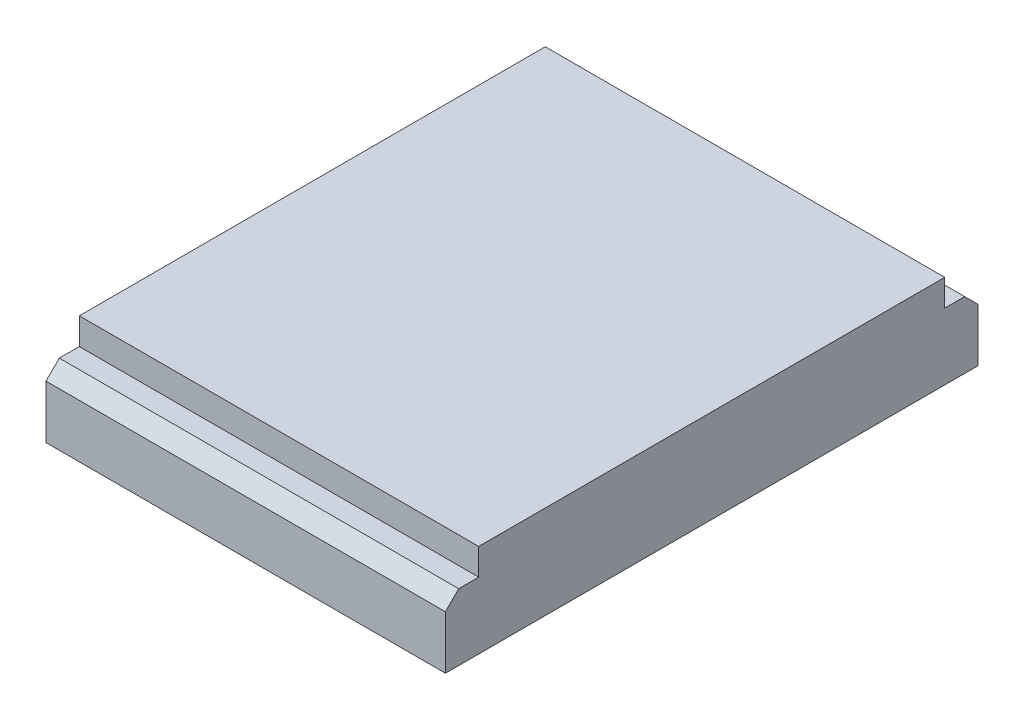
ISO-10303-21;
HEADER;
FILE_DESCRIPTION(('STEP AP214'),'2;1');
FILE_NAME('part.step','',(''),(''),'','','');
FILE_SCHEMA(('AUTOMOTIVE_DESIGN { 1 0 10303 214 1 1 1 1 }'));
ENDSEC;
DATA;
#1=APPLICATION_CONTEXT('core data for automotive mechanical design processes');
#2=APPLICATION_PROTOCOL_DEFINITION('international standard','automotive_design',2000,#1);
#3=PRODUCT_CONTEXT('',#1,'mechanical');
#4=PRODUCT('Part','Part','',(#3));
#5=PRODUCT_RELATED_PRODUCT_CATEGORY('part','',(#4));
#6=PRODUCT_DEFINITION_FORMATION('','',#4);
#7=PRODUCT_DEFINITION_CONTEXT('part definition',#1,'design');
#8=PRODUCT_DEFINITION('design','',#6,#7);
#9=PRODUCT_DEFINITION_SHAPE('','',#8);
#10=(LENGTH_UNIT() NAMED_UNIT(*) SI_UNIT(.MILLI.,.METRE.));
#11=(NAMED_UNIT(*) PLANE_ANGLE_UNIT() SI_UNIT($,.RADIAN.));
#12=(NAMED_UNIT(*) SI_UNIT($,.STERADIAN.) SOLID_ANGLE_UNIT());
#13=UNCERTAINTY_MEASURE_WITH_UNIT(LENGTH_MEASURE(1.E-05),#10,'distance_accuracy_value','');
#14=(GEOMETRIC_REPRESENTATION_CONTEXT(3) GLOBAL_UNCERTAINTY_ASSIGNED_CONTEXT((#13)) GLOBAL_UNIT_ASSIGNED_CONTEXT((#10,
#11,#12)) REPRESENTATION_CONTEXT('',''));
#15=CARTESIAN_POINT('',(0.,0.,0.));
#16=DIRECTION('',(0.,0.,1.));
#17=DIRECTION('',(1.,0.,0.));
#18=AXIS2_PLACEMENT_3D('',#15,#16,#17);
#19=CARTESIAN_POINT('',(0.,5.,20.));
#20=DIRECTION('',(0.,1.,0.));
#21=DIRECTION('',(0.,0.,1.));
#22=AXIS2_PLACEMENT_3D('',#19,#20,#21);
#23=PLANE('',#22);
#24=DIRECTION('',(0.,0.,-1.));
#25=VECTOR('',#24,1.);
#26=CARTESIAN_POINT('',(30.,5.,-20.));
#27=LINE('',#26,#25);
#28=CARTESIAN_POINT('',(30.,5.,-17.5));
#29=VERTEX_POINT('',#28);
#30=CARTESIAN_POINT('',(30.,5.,-19.));
#31=VERTEX_POINT('',#30);
#32=EDGE_CURVE('E109',#29,#31,#27,.T.);
#33=ORIENTED_EDGE('',*,*,#32,.T.);
#34=DIRECTION('',(-1.,0.,0.));
#35=VECTOR('',#34,1.);
#36=CARTESIAN_POINT('',(0.,5.,-19.));
#37=LINE('',#36,#35);
#38=CARTESIAN_POINT('',(0.,5.,-19.));
#39=VERTEX_POINT('',#38);
#40=EDGE_CURVE('E178',#31,#39,#37,.T.);
#41=ORIENTED_EDGE('',*,*,#40,.T.);
#42=DIRECTION('',(0.,0.,1.));
#43=VECTOR('',#42,1.);
#44=CARTESIAN_POINT('',(0.,5.,-20.));
#45=LINE('',#44,#43);
#46=CARTESIAN_POINT('',(0.,5.,-17.5));
#47=VERTEX_POINT('',#46);
#48=EDGE_CURVE('E174',#39,#47,#45,.T.);
#49=ORIENTED_EDGE('',*,*,#48,.T.);
#50=DIRECTION('',(-1.,0.,0.));
#51=VECTOR('',#50,1.);
#52=CARTESIAN_POINT('',(0.,5.,-17.5));
#53=LINE('',#52,#51);
#54=EDGE_CURVE('E119',#29,#47,#53,.T.);
#55=ORIENTED_EDGE('',*,*,#54,.F.);
#56=EDGE_LOOP('',(#33,#41,#49,#55));
#57=FACE_BOUND('',#56,.T.);
#58=ADVANCED_FACE('F27',(#57),#23,.T.);
#59=CARTESIAN_POINT('',(0.,5.,-20.));
#60=DIRECTION('',(1.,0.,0.));
#61=DIRECTION('',(0.,0.,-1.));
#62=AXIS2_PLACEMENT_3D('',#59,#60,#61);
#63=PLANE('',#62);
#64=ORIENTED_EDGE('',*,*,#48,.F.);
#65=DIRECTION('',(0.,-0.707106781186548,-0.707106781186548));
#66=VECTOR('',#65,1.);
#67=CARTESIAN_POINT('',(0.,5.,-19.));
#68=LINE('',#67,#66);
#69=CARTESIAN_POINT('',(0.,4.,-20.));
#70=VERTEX_POINT('',#69);
#71=EDGE_CURVE('E184',#39,#70,#68,.T.);
#72=ORIENTED_EDGE('',*,*,#71,.T.);
#73=DIRECTION('',(0.,-1.,0.));
#74=VECTOR('',#73,1.);
#75=CARTESIAN_POINT('',(0.,5.,-20.));
#76=LINE('',#75,#74);
#77=CARTESIAN_POINT('',(0.,0.,-20.));
#78=VERTEX_POINT('',#77);
#79=EDGE_CURVE('E108',#70,#78,#76,.T.);
#80=ORIENTED_EDGE('',*,*,#79,.T.);
#81=DIRECTION('',(0.,0.,1.));
#82=VECTOR('',#81,1.);
#83=CARTESIAN_POINT('',(0.,0.,-20.));
#84=LINE('',#83,#82);
#85=CARTESIAN_POINT('',(0.,0.,20.));
#86=VERTEX_POINT('',#85);
#87=EDGE_CURVE('E127',#78,#86,#84,.T.);
#88=ORIENTED_EDGE('',*,*,#87,.T.);
#89=DIRECTION('',(0.,-1.,0.));
#90=VECTOR('',#89,1.);
#91=CARTESIAN_POINT('',(0.,5.,20.));
#92=LINE('',#91,#90);
#93=CARTESIAN_POINT('',(0.,4.,20.));
#94=VERTEX_POINT('',#93);
#95=EDGE_CURVE('E182',#94,#86,#92,.T.);
#96=ORIENTED_EDGE('',*,*,#95,.F.);
#97=DIRECTION('',(0.,0.707106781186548,-0.707106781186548));
#98=VECTOR('',#97,1.);
#99=CARTESIAN_POINT('',(0.,5.,19.));
#100=LINE('',#99,#98);
#101=CARTESIAN_POINT('',(0.,5.,19.));
#102=VERTEX_POINT('',#101);
#103=EDGE_CURVE('E181',#94,#102,#100,.T.);
#104=ORIENTED_EDGE('',*,*,#103,.T.);
#105=CARTESIAN_POINT('',(0.,5.,17.5));
#106=VERTEX_POINT('',#105);
#107=EDGE_CURVE('E165',#106,#102,#45,.T.);
#108=ORIENTED_EDGE('',*,*,#107,.F.);
#109=DIRECTION('',(0.,-1.,0.));
#110=VECTOR('',#109,1.);
#111=CARTESIAN_POINT('',(0.,7.,17.5));
#112=LINE('',#111,#110);
#113=CARTESIAN_POINT('',(0.,7.,17.5));
#114=VERTEX_POINT('',#113);
#115=EDGE_CURVE('E118',#114,#106,#112,.T.);
#116=ORIENTED_EDGE('',*,*,#115,.F.);
#117=DIRECTION('',(0.,0.,1.));
#118=VECTOR('',#117,1.);
#119=CARTESIAN_POINT('',(0.,7.,-17.5));
#120=LINE('',#119,#118);
#121=CARTESIAN_POINT('',(0.,7.,-17.5));
#122=VERTEX_POINT('',#121);
#123=EDGE_CURVE('E142',#122,#114,#120,.T.);
#124=ORIENTED_EDGE('',*,*,#123,.F.);
#125=DIRECTION('',(0.,-1.,0.));
#126=VECTOR('',#125,1.);
#127=CARTESIAN_POINT('',(0.,7.,-17.5));
#128=LINE('',#127,#126);
#129=EDGE_CURVE('E130',#122,#47,#128,.T.);
#130=ORIENTED_EDGE('',*,*,#129,.T.);
#131=EDGE_LOOP('',(#64,#72,#80,#88,#96,#104,#108,#116,#124,#130));
#132=FACE_BOUND('',#131,.T.);
#133=ADVANCED_FACE('F29',(#132),#63,.F.);
#134=CARTESIAN_POINT('',(0.,5.,20.));
#135=DIRECTION('',(0.,0.,-1.));
#136=DIRECTION('',(-1.,0.,0.));
#137=AXIS2_PLACEMENT_3D('',#134,#135,#136);
#138=PLANE('',#137);
#139=DIRECTION('',(0.,-1.,0.));
#140=VECTOR('',#139,1.);
#141=CARTESIAN_POINT('',(30.,5.,20.));
#142=LINE('',#141,#140);
#143=CARTESIAN_POINT('',(30.,4.,20.));
#144=VERTEX_POINT('',#143);
#145=CARTESIAN_POINT('',(30.,0.,20.));
#146=VERTEX_POINT('',#145);
#147=EDGE_CURVE('E207',#144,#146,#142,.T.);
#148=ORIENTED_EDGE('',*,*,#147,.F.);
#149=DIRECTION('',(-1.,0.,0.));
#150=VECTOR('',#149,1.);
#151=CARTESIAN_POINT('',(0.,4.,20.));
#152=LINE('',#151,#150);
#153=EDGE_CURVE('E11',#144,#94,#152,.T.);
#154=ORIENTED_EDGE('',*,*,#153,.T.);
#155=ORIENTED_EDGE('',*,*,#95,.T.);
#156=DIRECTION('',(1.,0.,0.));
#157=VECTOR('',#156,1.);
#158=CARTESIAN_POINT('',(0.,0.,20.));
#159=LINE('',#158,#157);
#160=EDGE_CURVE('E156',#86,#146,#159,.T.);
#161=ORIENTED_EDGE('',*,*,#160,.T.);
#162=EDGE_LOOP('',(#148,#154,#155,#161));
#163=FACE_BOUND('',#162,.T.);
#164=ADVANCED_FACE('F213',(#163),#138,.F.);
#165=CARTESIAN_POINT('',(30.,5.,-20.));
#166=DIRECTION('',(-1.,0.,0.));
#167=DIRECTION('',(0.,0.,1.));
#168=AXIS2_PLACEMENT_3D('',#165,#166,#167);
#169=PLANE('',#168);
#170=DIRECTION('',(0.,-1.,0.));
#171=VECTOR('',#170,1.);
#172=CARTESIAN_POINT('',(30.,5.,-20.));
#173=LINE('',#172,#171);
#174=CARTESIAN_POINT('',(30.,4.,-20.));
#175=VERTEX_POINT('',#174);
#176=CARTESIAN_POINT('',(30.,0.,-20.));
#177=VERTEX_POINT('',#176);
#178=EDGE_CURVE('E193',#175,#177,#173,.T.);
#179=ORIENTED_EDGE('',*,*,#178,.F.);
#180=DIRECTION('',(0.,0.707106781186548,0.707106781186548));
#181=VECTOR('',#180,1.);
#182=CARTESIAN_POINT('',(30.,5.,-19.));
#183=LINE('',#182,#181);
#184=EDGE_CURVE('E189',#175,#31,#183,.T.);
#185=ORIENTED_EDGE('',*,*,#184,.T.);
#186=ORIENTED_EDGE('',*,*,#32,.F.);
#187=DIRECTION('',(0.,-1.,0.));
#188=VECTOR('',#187,1.);
#189=CARTESIAN_POINT('',(30.,7.,-17.5));
#190=LINE('',#189,#188);
#191=CARTESIAN_POINT('',(30.,7.,-17.5));
#192=VERTEX_POINT('',#191);
#193=EDGE_CURVE('E125',#192,#29,#190,.T.);
#194=ORIENTED_EDGE('',*,*,#193,.F.);
#195=DIRECTION('',(0.,0.,-1.));
#196=VECTOR('',#195,1.);
#197=CARTESIAN_POINT('',(30.,7.,-17.5));
#198=LINE('',#197,#196);
#199=CARTESIAN_POINT('',(30.,7.,17.5));
#200=VERTEX_POINT('',#199);
#201=EDGE_CURVE('E124',#200,#192,#198,.T.);
#202=ORIENTED_EDGE('',*,*,#201,.F.);
#203=DIRECTION('',(0.,-1.,0.));
#204=VECTOR('',#203,1.);
#205=CARTESIAN_POINT('',(30.,7.,17.5));
#206=LINE('',#205,#204);
#207=CARTESIAN_POINT('',(30.,5.,17.5));
#208=VERTEX_POINT('',#207);
#209=EDGE_CURVE('E115',#200,#208,#206,.T.);
#210=ORIENTED_EDGE('',*,*,#209,.T.);
#211=CARTESIAN_POINT('',(30.,5.,19.));
#212=VERTEX_POINT('',#211);
#213=EDGE_CURVE('E101',#212,#208,#27,.T.);
#214=ORIENTED_EDGE('',*,*,#213,.F.);
#215=DIRECTION('',(0.,-0.707106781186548,0.707106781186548));
#216=VECTOR('',#215,1.);
#217=CARTESIAN_POINT('',(30.,5.,19.));
#218=LINE('',#217,#216);
#219=EDGE_CURVE('E42',#212,#144,#218,.T.);
#220=ORIENTED_EDGE('',*,*,#219,.T.);
#221=ORIENTED_EDGE('',*,*,#147,.T.);
#222=DIRECTION('',(0.,0.,-1.));
#223=VECTOR('',#222,1.);
#224=CARTESIAN_POINT('',(30.,0.,-20.));
#225=LINE('',#224,#223);
#226=EDGE_CURVE('E159',#146,#177,#225,.T.);
#227=ORIENTED_EDGE('',*,*,#226,.T.);
#228=EDGE_LOOP('',(#179,#185,#186,#194,#202,#210,#214,#220,#221,#227));
#229=FACE_BOUND('',#228,.T.);
#230=ADVANCED_FACE('F122',(#229),#169,.F.);
#231=CARTESIAN_POINT('',(0.,5.,-20.));
#232=DIRECTION('',(0.,0.,1.));
#233=DIRECTION('',(1.,0.,0.));
#234=AXIS2_PLACEMENT_3D('',#231,#232,#233);
#235=PLANE('',#234);
#236=ORIENTED_EDGE('',*,*,#79,.F.);
#237=DIRECTION('',(1.,0.,0.));
#238=VECTOR('',#237,1.);
#239=CARTESIAN_POINT('',(30.,4.,-20.));
#240=LINE('',#239,#238);
#241=EDGE_CURVE('E186',#70,#175,#240,.T.);
#242=ORIENTED_EDGE('',*,*,#241,.T.);
#243=ORIENTED_EDGE('',*,*,#178,.T.);
#244=DIRECTION('',(-1.,0.,0.));
#245=VECTOR('',#244,1.);
#246=CARTESIAN_POINT('',(0.,0.,-20.));
#247=LINE('',#246,#245);
#248=EDGE_CURVE('E162',#177,#78,#247,.T.);
#249=ORIENTED_EDGE('',*,*,#248,.T.);
#250=EDGE_LOOP('',(#236,#242,#243,#249));
#251=FACE_BOUND('',#250,.T.);
#252=ADVANCED_FACE('F204',(#251),#235,.F.);
#253=ORIENTED_EDGE('',*,*,#107,.T.);
#254=DIRECTION('',(1.,0.,0.));
#255=VECTOR('',#254,1.);
#256=CARTESIAN_POINT('',(30.,5.,19.));
#257=LINE('',#256,#255);
#258=EDGE_CURVE('E35',#102,#212,#257,.T.);
#259=ORIENTED_EDGE('',*,*,#258,.T.);
#260=ORIENTED_EDGE('',*,*,#213,.T.);
#261=DIRECTION('',(1.,0.,0.));
#262=VECTOR('',#261,1.);
#263=CARTESIAN_POINT('',(0.,5.,17.5));
#264=LINE('',#263,#262);
#265=EDGE_CURVE('E105',#106,#208,#264,.T.);
#266=ORIENTED_EDGE('',*,*,#265,.F.);
#267=EDGE_LOOP('',(#253,#259,#260,#266));
#268=FACE_BOUND('',#267,.T.);
#269=ADVANCED_FACE('F104',(#268),#23,.T.);
#270=CARTESIAN_POINT('',(0.,0.,20.));
#271=DIRECTION('',(0.,1.,0.));
#272=DIRECTION('',(0.,0.,1.));
#273=AXIS2_PLACEMENT_3D('',#270,#271,#272);
#274=PLANE('',#273);
#275=ORIENTED_EDGE('',*,*,#87,.F.);
#276=ORIENTED_EDGE('',*,*,#248,.F.);
#277=ORIENTED_EDGE('',*,*,#226,.F.);
#278=ORIENTED_EDGE('',*,*,#160,.F.);
#279=EDGE_LOOP('',(#275,#276,#277,#278));
#280=FACE_BOUND('',#279,.T.);
#281=ADVANCED_FACE('F217',(#280),#274,.F.);
#282=CARTESIAN_POINT('',(0.,7.,17.5));
#283=DIRECTION('',(0.,0.,-1.));
#284=DIRECTION('',(-1.,0.,0.));
#285=AXIS2_PLACEMENT_3D('',#282,#283,#284);
#286=PLANE('',#285);
#287=ORIENTED_EDGE('',*,*,#265,.T.);
#288=ORIENTED_EDGE('',*,*,#209,.F.);
#289=DIRECTION('',(1.,0.,0.));
#290=VECTOR('',#289,1.);
#291=CARTESIAN_POINT('',(0.,7.,17.5));
#292=LINE('',#291,#290);
#293=EDGE_CURVE('E149',#114,#200,#292,.T.);
#294=ORIENTED_EDGE('',*,*,#293,.F.);
#295=ORIENTED_EDGE('',*,*,#115,.T.);
#296=EDGE_LOOP('',(#287,#288,#294,#295));
#297=FACE_BOUND('',#296,.T.);
#298=ADVANCED_FACE('F114',(#297),#286,.F.);
#299=CARTESIAN_POINT('',(0.,7.,-17.5));
#300=DIRECTION('',(0.,0.,1.));
#301=DIRECTION('',(1.,0.,0.));
#302=AXIS2_PLACEMENT_3D('',#299,#300,#301);
#303=PLANE('',#302);
#304=ORIENTED_EDGE('',*,*,#54,.T.);
#305=ORIENTED_EDGE('',*,*,#129,.F.);
#306=DIRECTION('',(-1.,0.,0.));
#307=VECTOR('',#306,1.);
#308=CARTESIAN_POINT('',(0.,7.,-17.5));
#309=LINE('',#308,#307);
#310=EDGE_CURVE('E152',#192,#122,#309,.T.);
#311=ORIENTED_EDGE('',*,*,#310,.F.);
#312=ORIENTED_EDGE('',*,*,#193,.T.);
#313=EDGE_LOOP('',(#304,#305,#311,#312));
#314=FACE_BOUND('',#313,.T.);
#315=ADVANCED_FACE('F225',(#314),#303,.F.);
#316=CARTESIAN_POINT('',(0.,7.,17.5));
#317=DIRECTION('',(0.,1.,0.));
#318=DIRECTION('',(0.,0.,1.));
#319=AXIS2_PLACEMENT_3D('',#316,#317,#318);
#320=PLANE('',#319);
#321=ORIENTED_EDGE('',*,*,#123,.T.);
#322=ORIENTED_EDGE('',*,*,#293,.T.);
#323=ORIENTED_EDGE('',*,*,#201,.T.);
#324=ORIENTED_EDGE('',*,*,#310,.T.);
#325=EDGE_LOOP('',(#321,#322,#323,#324));
#326=FACE_BOUND('',#325,.T.);
#327=ADVANCED_FACE('F222',(#326),#320,.T.);
#328=CARTESIAN_POINT('',(0.,5.,-19.));
#329=DIRECTION('',(0.,0.707106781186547,-0.707106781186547));
#330=DIRECTION('',(0.,0.707106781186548,0.707106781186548));
#331=AXIS2_PLACEMENT_3D('',#328,#329,#330);
#332=PLANE('',#331);
#333=ORIENTED_EDGE('',*,*,#184,.F.);
#334=ORIENTED_EDGE('',*,*,#241,.F.);
#335=ORIENTED_EDGE('',*,*,#71,.F.);
#336=ORIENTED_EDGE('',*,*,#40,.F.);
#337=EDGE_LOOP('',(#333,#334,#335,#336));
#338=FACE_BOUND('',#337,.T.);
#339=ADVANCED_FACE('F199',(#338),#332,.T.);
#340=CARTESIAN_POINT('',(0.,5.,19.));
#341=DIRECTION('',(0.,0.707106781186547,0.707106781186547));
#342=DIRECTION('',(0.,-0.707106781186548,0.707106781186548));
#343=AXIS2_PLACEMENT_3D('',#340,#341,#342);
#344=PLANE('',#343);
#345=ORIENTED_EDGE('',*,*,#103,.F.);
#346=ORIENTED_EDGE('',*,*,#153,.F.);
#347=ORIENTED_EDGE('',*,*,#219,.F.);
#348=ORIENTED_EDGE('',*,*,#258,.F.);
#349=EDGE_LOOP('',(#345,#346,#347,#348));
#350=FACE_BOUND('',#349,.T.);
#351=ADVANCED_FACE('F218',(#350),#344,.T.);
#352=CLOSED_SHELL('',(#58,#133,#164,#230,#252,#269,#281,#298,#315,#327,#339,#351));
#353=MANIFOLD_SOLID_BREP('B2',#352);
#354=ADVANCED_BREP_SHAPE_REPRESENTATION('',(#18,#353),#14);
#355=SHAPE_DEFINITION_REPRESENTATION(#9,#354);
ENDSEC;
END-ISO-10303-21;
